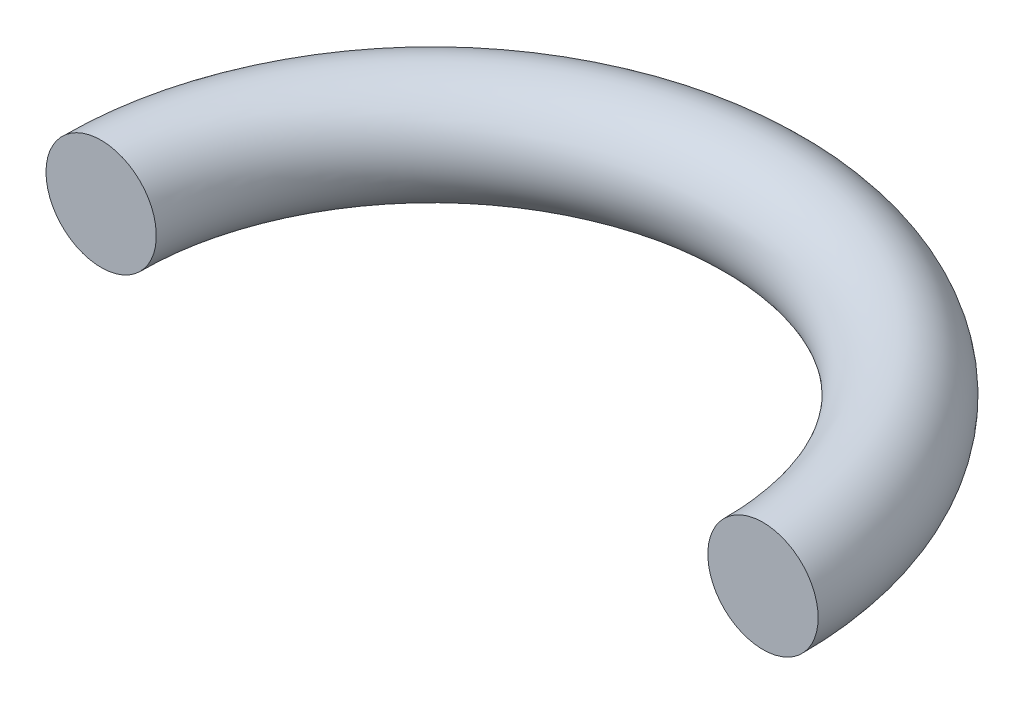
from build123d import *

# Parameters (mm, degrees)
ESBO_O1_R       = 0.5
REVOLU_O1_ANGLE = 180


with BuildPart() as part:
    # Esbo_o1 → Revolu_o1 (revolve)
    with BuildSketch(Plane.XY):
        with Locations((-3, 0)):
            Circle(ESBO_O1_R)
    revolve(axis=Axis((0, -6.469687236, 0), (0, -1, 0)), revolution_arc=REVOLU_O1_ANGLE)


solid = part.part
